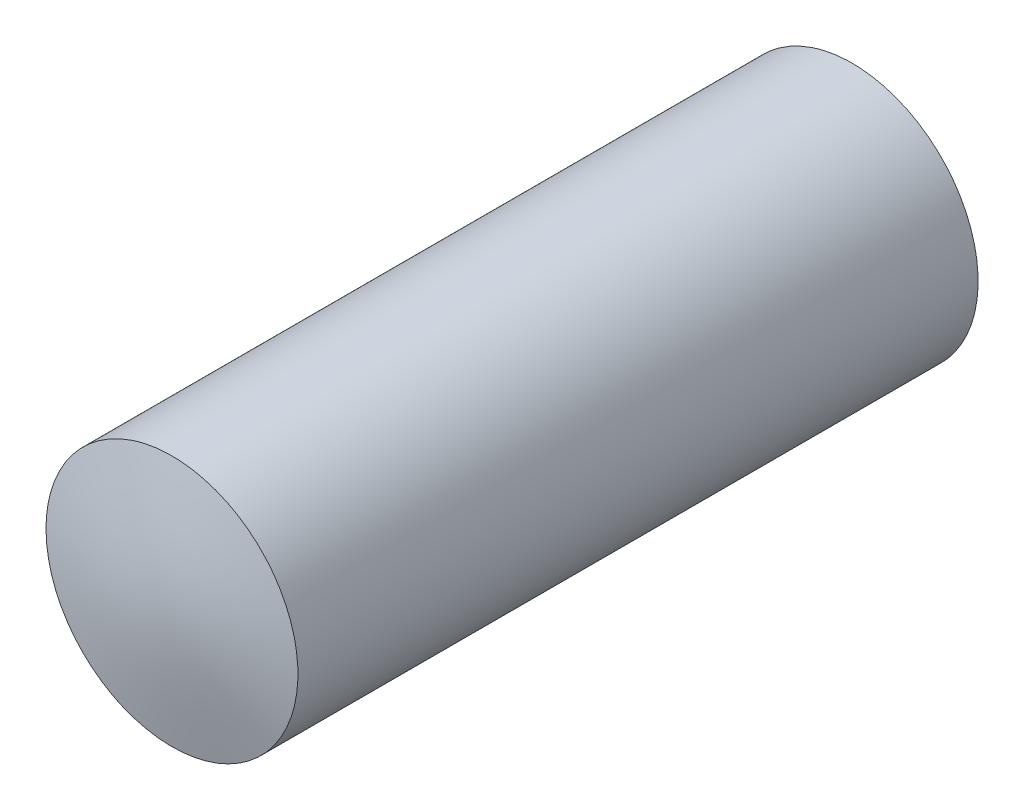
ISO-10303-21;
HEADER;
FILE_DESCRIPTION(('STEP AP214'),'2;1');
FILE_NAME('part.step','',(''),(''),'','','');
FILE_SCHEMA(('AUTOMOTIVE_DESIGN { 1 0 10303 214 1 1 1 1 }'));
ENDSEC;
DATA;
#1=APPLICATION_CONTEXT('core data for automotive mechanical design processes');
#2=APPLICATION_PROTOCOL_DEFINITION('international standard','automotive_design',2000,#1);
#3=PRODUCT_CONTEXT('',#1,'mechanical');
#4=PRODUCT('Part','Part','',(#3));
#5=PRODUCT_RELATED_PRODUCT_CATEGORY('part','',(#4));
#6=PRODUCT_DEFINITION_FORMATION('','',#4);
#7=PRODUCT_DEFINITION_CONTEXT('part definition',#1,'design');
#8=PRODUCT_DEFINITION('design','',#6,#7);
#9=PRODUCT_DEFINITION_SHAPE('','',#8);
#10=(LENGTH_UNIT() NAMED_UNIT(*) SI_UNIT(.MILLI.,.METRE.));
#11=(NAMED_UNIT(*) PLANE_ANGLE_UNIT() SI_UNIT($,.RADIAN.));
#12=(NAMED_UNIT(*) SI_UNIT($,.STERADIAN.) SOLID_ANGLE_UNIT());
#13=UNCERTAINTY_MEASURE_WITH_UNIT(LENGTH_MEASURE(1.E-05),#10,'distance_accuracy_value','');
#14=(GEOMETRIC_REPRESENTATION_CONTEXT(3) GLOBAL_UNCERTAINTY_ASSIGNED_CONTEXT((#13)) GLOBAL_UNIT_ASSIGNED_CONTEXT((#10,
#11,#12)) REPRESENTATION_CONTEXT('',''));
#15=CARTESIAN_POINT('',(0.,0.,0.));
#16=DIRECTION('',(0.,0.,1.));
#17=DIRECTION('',(1.,0.,0.));
#18=AXIS2_PLACEMENT_3D('',#15,#16,#17);
#19=CARTESIAN_POINT('',(0.,0.,16.2));
#20=DIRECTION('',(0.,0.,-1.));
#21=DIRECTION('',(-1.,0.,0.));
#22=AXIS2_PLACEMENT_3D('',#19,#20,#21);
#23=CYLINDRICAL_SURFACE('',#22,3.);
#24=CARTESIAN_POINT('',(-3.,1.29930179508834E-12,16.200141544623));
#25=CARTESIAN_POINT('',(-2.99999252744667,-0.168511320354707,16.2001422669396));
#26=CARTESIAN_POINT('',(-2.98575432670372,-0.337144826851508,16.2001584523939));
#27=CARTESIAN_POINT('',(-2.92915290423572,-0.669767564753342,16.2001462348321));
#28=CARTESIAN_POINT('',(-2.88675583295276,-0.833750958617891,16.2001177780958));
#29=CARTESIAN_POINT('',(-2.77504361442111,-1.1522065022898,16.2001001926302));
#30=CARTESIAN_POINT('',(-2.70574132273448,-1.30668315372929,16.2001110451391));
#31=CARTESIAN_POINT('',(-2.54220356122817,-1.60176565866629,16.200143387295));
#32=CARTESIAN_POINT('',(-2.44797429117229,-1.742374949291,16.2001648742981));
#33=CARTESIAN_POINT('',(-2.23723837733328,-2.00579557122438,16.2001895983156));
#34=CARTESIAN_POINT('',(-2.12072940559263,-2.1286050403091,16.2001928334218));
#35=CARTESIAN_POINT('',(-1.86874257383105,-2.3529252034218,16.2001785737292));
#36=CARTESIAN_POINT('',(-1.73326396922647,-2.45443506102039,16.2001610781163));
#37=CARTESIAN_POINT('',(-1.44719005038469,-2.63326699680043,16.2001199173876));
#38=CARTESIAN_POINT('',(-1.29659501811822,-2.71058952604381,16.2000962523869));
#39=CARTESIAN_POINT('',(-0.984561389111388,-2.83885417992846,16.200101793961));
#40=CARTESIAN_POINT('',(-0.82312281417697,-2.88979635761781,16.2001310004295));
#41=CARTESIAN_POINT('',(-0.493984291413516,-2.96385454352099,16.2001588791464));
#42=CARTESIAN_POINT('',(-0.326284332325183,-2.98697050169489,16.2001575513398));
#43=CARTESIAN_POINT('',(0.0106158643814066,-3.00471986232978,16.2001630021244));
#44=CARTESIAN_POINT('',(0.179816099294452,-2.99935331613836,16.2001697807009));
#45=CARTESIAN_POINT('',(0.514914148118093,-2.96029011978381,16.2001549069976));
#46=CARTESIAN_POINT('',(0.680811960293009,-2.92659345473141,16.2001332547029));
#47=CARTESIAN_POINT('',(1.00459590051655,-2.83182649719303,16.2001046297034));
#48=CARTESIAN_POINT('',(1.16248202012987,-2.77075617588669,16.2000976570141));
#49=CARTESIAN_POINT('',(1.46576039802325,-2.62297553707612,16.200117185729));
#50=CARTESIAN_POINT('',(1.61115266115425,-2.53626522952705,16.2001436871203));
#51=CARTESIAN_POINT('',(1.88531608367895,-2.33966609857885,16.2001800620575));
#52=CARTESIAN_POINT('',(2.01408724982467,-2.22977728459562,16.2001899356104));
#53=CARTESIAN_POINT('',(2.25135314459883,-1.98994050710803,16.2001890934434));
#54=CARTESIAN_POINT('',(2.35984786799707,-1.85999253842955,16.2001783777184));
#55=CARTESIAN_POINT('',(2.55348100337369,-1.58372629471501,16.2001429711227));
#56=CARTESIAN_POINT('',(2.6386194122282,-1.43740801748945,16.2001182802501));
#57=CARTESIAN_POINT('',(2.78312306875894,-1.13255471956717,16.2001042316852));
#58=CARTESIAN_POINT('',(2.84248831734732,-0.974019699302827,16.2001148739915));
#59=CARTESIAN_POINT('',(2.93376044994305,-0.649233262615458,16.2001363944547));
#60=CARTESIAN_POINT('',(2.96566733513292,-0.482981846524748,16.2001472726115));
#61=CARTESIAN_POINT('',(3.00111700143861,-0.147482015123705,16.2001519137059));
#62=CARTESIAN_POINT('',(3.00465978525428,0.0217663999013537,16.2001456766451));
#63=CARTESIAN_POINT('',(2.98328068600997,0.358455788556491,16.2001445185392));
#64=CARTESIAN_POINT('',(2.95835880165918,0.525896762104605,16.2001495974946));
#65=CARTESIAN_POINT('',(2.88075781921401,0.854218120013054,16.2001305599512));
#66=CARTESIAN_POINT('',(2.82807871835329,1.01509850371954,16.2001064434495));
#67=CARTESIAN_POINT('',(2.6964587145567,1.32573172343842,16.2001053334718));
#68=CARTESIAN_POINT('',(2.61751781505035,1.47548456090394,16.2001283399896));
#69=CARTESIAN_POINT('',(2.43561513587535,1.75961163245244,16.2001666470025));
#70=CARTESIAN_POINT('',(2.33265336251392,1.8939858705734,16.2001819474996));
#71=CARTESIAN_POINT('',(2.10563165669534,2.14354135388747,16.2001926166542));
#72=CARTESIAN_POINT('',(1.98157171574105,2.25872259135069,16.2001879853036));
#73=CARTESIAN_POINT('',(1.71587535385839,2.46662238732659,16.2001592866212));
#74=CARTESIAN_POINT('',(1.57423892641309,2.55934093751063,16.2001352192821));
#75=CARTESIAN_POINT('',(1.27741042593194,2.71968321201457,16.2001025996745));
#76=CARTESIAN_POINT('',(1.12221836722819,2.78730696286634,16.2000940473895));
#77=CARTESIAN_POINT('',(0.802683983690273,2.89554011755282,16.2001176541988));
#78=CARTESIAN_POINT('',(0.638341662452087,2.93614953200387,16.200149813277));
#79=CARTESIAN_POINT('',(0.305171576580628,2.98920132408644,16.2001707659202));
#80=CARTESIAN_POINT('',(0.136343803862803,3.00164365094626,16.200159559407));
#81=CARTESIAN_POINT('',(-0.201004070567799,2.99800792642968,16.2001586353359));
#82=CARTESIAN_POINT('',(-0.369524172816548,2.98192992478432,16.2001689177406));
#83=CARTESIAN_POINT('',(-0.701473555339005,2.92170995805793,16.2001451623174));
#84=CARTESIAN_POINT('',(-0.864902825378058,2.87756793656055,16.2001111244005));
#85=CARTESIAN_POINT('',(-1.18203386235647,2.7624719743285,16.2000922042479));
#86=CARTESIAN_POINT('',(-1.33573544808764,2.69151753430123,16.2001073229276));
#87=CARTESIAN_POINT('',(-1.62903875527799,2.52481392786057,16.2001445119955));
#88=CARTESIAN_POINT('',(-1.76864103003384,2.42906573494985,16.2001665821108));
#89=CARTESIAN_POINT('',(-2.02977595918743,2.21550403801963,16.2001906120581));
#90=CARTESIAN_POINT('',(-2.15131050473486,2.09769284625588,16.2001925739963));
#91=CARTESIAN_POINT('',(-2.37290656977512,1.84330447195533,16.2001769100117));
#92=CARTESIAN_POINT('',(-2.47296274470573,1.7067226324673,16.2001592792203));
#93=CARTESIAN_POINT('',(-2.64876247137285,1.41864627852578,16.2001216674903));
#94=CARTESIAN_POINT('',(-2.72449439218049,1.26714467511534,16.2001016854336));
#95=CARTESIAN_POINT('',(-2.84936113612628,0.953696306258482,16.2001089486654));
#96=CARTESIAN_POINT('',(-2.89852784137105,0.791762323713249,16.2001361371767));
#97=CARTESIAN_POINT('',(-2.95576453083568,0.523996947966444,16.200152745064));
#98=CARTESIAN_POINT('',(-2.97233212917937,0.419905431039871,16.2001525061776));
#99=CARTESIAN_POINT('',(-2.99445219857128,0.210558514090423,16.2001466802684));
#100=CARTESIAN_POINT('',(-3.00000466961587,0.105303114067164,16.2001410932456));
#101=CARTESIAN_POINT('',(-3.,1.29930179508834E-12,16.200141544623));
#102=B_SPLINE_CURVE_WITH_KNOTS('',3,(#24,#25,#26,#27,#28,#29,#30,#31,#32,#33,#34,#35,#36,#37,
#38,#39,#40,#41,#42,#43,#44,#45,#46,#47,#48,#49,#50,#51,#52,#53,#54,#55,#56,#57,#58,#59,#60,#61,
#62,#63,#64,#65,#66,#67,#68,#69,#70,#71,#72,#73,#74,#75,#76,#77,#78,#79,#80,#81,#82,#83,#84,#85,
#86,#87,#88,#89,#90,#91,#92,#93,#94,#95,#96,#97,#98,#99,#100,#101),.UNSPECIFIED.,.T.,.F.,(4,2,2,
2,2,2,2,2,2,2,2,2,2,2,2,2,2,2,2,2,2,2,2,2,2,2,2,2,2,2,2,2,2,2,2,2,2,2,4),(0.,0.505149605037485,
1.01090754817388,1.51642413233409,2.02181510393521,2.52725891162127,3.03272256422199,
3.53817679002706,4.04362999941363,4.54908411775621,5.05453732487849,5.55999079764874,
6.06544480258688,6.57089861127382,7.07635221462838,7.58180594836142,8.08725974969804,
8.59271353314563,9.09816729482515,9.6036210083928,10.1090747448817,10.6145285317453,
11.119982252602,11.625435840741,12.1308896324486,12.6363436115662,13.1417970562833,
13.6472503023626,14.15270445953,14.6581577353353,15.1636120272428,15.6690757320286,
16.1745195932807,16.6799105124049,17.185427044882,17.6911849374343,18.1963344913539,
18.512003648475,18.8276728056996),.UNSPECIFIED.);
#103=CARTESIAN_POINT('',(-3.,1.29930179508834E-12,16.200141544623));
#104=VERTEX_POINT('',#103);
#105=EDGE_CURVE('E12',#104,#104,#102,.T.);
#106=ORIENTED_EDGE('',*,*,#105,.F.);
#107=EDGE_LOOP('',(#106));
#108=FACE_BOUND('',#107,.T.);
#109=CARTESIAN_POINT('',(-3.,-1.40860975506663E-12,-0.000141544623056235));
#110=CARTESIAN_POINT('',(-2.99999252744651,-0.168511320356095,-0.000142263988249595));
#111=CARTESIAN_POINT('',(-2.98575432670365,-0.337144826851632,-0.000158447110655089));
#112=CARTESIAN_POINT('',(-2.92915290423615,-0.669767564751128,-0.000146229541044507));
#113=CARTESIAN_POINT('',(-2.88675583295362,-0.833750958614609,-0.000117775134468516));
#114=CARTESIAN_POINT('',(-2.77504361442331,-1.15220650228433,-0.000100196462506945));
#115=CARTESIAN_POINT('',(-2.70574132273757,-1.30668315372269,-0.000111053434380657));
#116=CARTESIAN_POINT('',(-2.54220356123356,-1.60176565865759,-0.000143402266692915));
#117=CARTESIAN_POINT('',(-2.44797429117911,-1.74237494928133,-0.000164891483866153));
#118=CARTESIAN_POINT('',(-2.23723837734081,-2.0057955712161,-0.000189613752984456));
#119=CARTESIAN_POINT('',(-2.12072940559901,-2.12860504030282,-0.000192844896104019));
#120=CARTESIAN_POINT('',(-1.86874257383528,-2.35292520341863,-0.000178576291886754));
#121=CARTESIAN_POINT('',(-1.73326396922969,-2.4544350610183,-0.000161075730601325));
#122=CARTESIAN_POINT('',(-1.44719005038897,-2.63326699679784,-0.000119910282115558));
#123=CARTESIAN_POINT('',(-1.296595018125,-2.71058952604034,-9.62455098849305E-05));
#124=CARTESIAN_POINT('',(-0.984561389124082,-2.83885417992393,-0.000101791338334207));
#125=CARTESIAN_POINT('',(-0.823122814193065,-2.88979635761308,-0.000131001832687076));
#126=CARTESIAN_POINT('',(-0.49398429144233,-2.96385454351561,-0.000158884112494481));
#127=CARTESIAN_POINT('',(-0.326284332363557,-2.98697050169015,-0.000157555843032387));
#128=CARTESIAN_POINT('',(0.0106158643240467,-3.00471986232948,-0.000163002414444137));
#129=CARTESIAN_POINT('',(0.179816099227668,-2.99935331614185,-0.0001697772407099));
#130=CARTESIAN_POINT('',(0.514914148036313,-2.96029011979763,-0.00015490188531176));
#131=CARTESIAN_POINT('',(0.680811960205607,-2.92659345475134,-0.000133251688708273));
#132=CARTESIAN_POINT('',(1.00459590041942,-2.8318264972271,-0.000104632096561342));
#133=CARTESIAN_POINT('',(1.16248202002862,-2.77075617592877,-9.76627164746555E-05));
#134=CARTESIAN_POINT('',(1.46576039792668,-2.62297553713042,-0.000117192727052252));
#135=CARTESIAN_POINT('',(1.61115266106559,-2.53626522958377,-0.000143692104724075));
#136=CARTESIAN_POINT('',(1.88531608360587,-2.33966609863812,-0.000180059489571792));
#137=CARTESIAN_POINT('',(2.01408724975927,-2.22977728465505,-0.00018992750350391));
#138=CARTESIAN_POINT('',(2.25135314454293,-1.98994050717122,-0.000189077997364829));
#139=CARTESIAN_POINT('',(2.35984786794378,-1.85999253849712,-0.000178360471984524));
#140=CARTESIAN_POINT('',(2.5534810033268,-1.58372629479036,-0.000142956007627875));
#141=CARTESIAN_POINT('',(2.63861941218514,-1.43740801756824,-0.000118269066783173));
#142=CARTESIAN_POINT('',(2.78312306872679,-1.13255471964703,-0.000104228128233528));
#143=CARTESIAN_POINT('',(2.84248831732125,-0.974019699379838,-0.000114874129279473));
#144=CARTESIAN_POINT('',(2.93376044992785,-0.64923326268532,-0.000136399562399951));
#145=CARTESIAN_POINT('',(2.96566733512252,-0.48298184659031,-0.000147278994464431));
#146=CARTESIAN_POINT('',(3.00111700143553,-0.147482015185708,-0.000151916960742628));
#147=CARTESIAN_POINT('',(3.00465978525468,0.0217663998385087,-0.000145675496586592));
#148=CARTESIAN_POINT('',(2.98328068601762,0.358455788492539,-0.000144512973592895));
#149=CARTESIAN_POINT('',(2.95835880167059,0.525896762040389,-0.000149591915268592));
#150=CARTESIAN_POINT('',(2.88075781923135,0.854218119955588,-0.000130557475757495));
#151=CARTESIAN_POINT('',(2.82807871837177,1.01509850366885,-0.000106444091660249));
#152=CARTESIAN_POINT('',(2.69645871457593,1.32573172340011,-0.000105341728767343));
#153=CARTESIAN_POINT('',(2.61751781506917,1.47548456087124,-0.00012835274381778));
#154=CARTESIAN_POINT('',(2.43561513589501,1.75961163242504,-0.000166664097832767));
#155=CARTESIAN_POINT('',(2.3326533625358,1.89398587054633,-0.000181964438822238));
#156=CARTESIAN_POINT('',(2.10563165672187,2.14354135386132,-0.00019262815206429));
#157=CARTESIAN_POINT('',(1.98157171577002,2.25872259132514,-0.000187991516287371));
#158=CARTESIAN_POINT('',(1.71587535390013,2.46662238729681,-0.000159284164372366));
#159=CARTESIAN_POINT('',(1.57423892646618,2.55934093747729,-0.000135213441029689));
#160=CARTESIAN_POINT('',(1.27741042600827,2.719683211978,-0.000102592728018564));
#161=CARTESIAN_POINT('',(1.12221836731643,2.78730696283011,-9.40427219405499E-05));
#162=CARTESIAN_POINT('',(0.802683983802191,2.89554011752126,-0.000117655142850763));
#163=CARTESIAN_POINT('',(0.638341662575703,2.93614953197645,-0.000149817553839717));
#164=CARTESIAN_POINT('',(0.305171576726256,2.98920132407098,-0.00017077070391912));
#165=CARTESIAN_POINT('',(0.136343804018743,3.0016436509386,-0.00015956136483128));
#166=CARTESIAN_POINT('',(-0.201004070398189,2.99800792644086,-0.000158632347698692));
#167=CARTESIAN_POINT('',(-0.36952417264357,2.98192992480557,-0.000168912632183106));
#168=CARTESIAN_POINT('',(-0.701473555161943,2.92170995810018,-0.000145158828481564));
#169=CARTESIAN_POINT('',(-0.864902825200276,2.87756793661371,-0.000111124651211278));
#170=CARTESIAN_POINT('',(-1.18203386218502,2.76247197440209,-9.2209868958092E-05));
#171=CARTESIAN_POINT('',(-1.33573544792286,2.69151753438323,-0.000107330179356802));
#172=CARTESIAN_POINT('',(-1.62903875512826,2.52481392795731,-0.00014451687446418));
#173=CARTESIAN_POINT('',(-1.76864102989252,2.42906573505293,-0.00016658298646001));
#174=CARTESIAN_POINT('',(-2.02977595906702,2.21550403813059,-0.000190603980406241));
#175=CARTESIAN_POINT('',(-2.15131050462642,2.09769284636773,-0.000192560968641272));
#176=CARTESIAN_POINT('',(-2.37290656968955,1.84330447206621,-0.000176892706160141));
#177=CARTESIAN_POINT('',(-2.47296274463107,1.70672263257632,-0.00015926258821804));
#178=CARTESIAN_POINT('',(-2.64876247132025,1.41864627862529,-0.000121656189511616));
#179=CARTESIAN_POINT('',(-2.72449439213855,1.26714467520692,-0.000101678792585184));
#180=CARTESIAN_POINT('',(-2.84936113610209,0.953696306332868,-0.000108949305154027));
#181=CARTESIAN_POINT('',(-2.89852784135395,0.791762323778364,-0.0001361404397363));
#182=CARTESIAN_POINT('',(-2.95576453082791,0.523996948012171,-0.000152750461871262));
#183=CARTESIAN_POINT('',(-2.97233212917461,0.419905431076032,-0.000152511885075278));
#184=CARTESIAN_POINT('',(-2.99445219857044,0.21055851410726,-0.000146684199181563));
#185=CARTESIAN_POINT('',(-3.00000466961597,0.105303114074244,-0.000141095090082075));
#186=CARTESIAN_POINT('',(-3.,-1.40860975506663E-12,-0.000141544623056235));
#187=B_SPLINE_CURVE_WITH_KNOTS('',3,(#109,#110,#111,#112,#113,#114,#115,#116,#117,#118,#119,
#120,#121,#122,#123,#124,#125,#126,#127,#128,#129,#130,#131,#132,#133,#134,#135,#136,#137,#138,
#139,#140,#141,#142,#143,#144,#145,#146,#147,#148,#149,#150,#151,#152,#153,#154,#155,#156,#157,
#158,#159,#160,#161,#162,#163,#164,#165,#166,#167,#168,#169,#170,#171,#172,#173,#174,#175,#176,
#177,#178,#179,#180,#181,#182,#183,#184,#185,#186),.UNSPECIFIED.,.T.,.F.,(4,2,2,2,2,2,2,2,2,2,2,
2,2,2,2,2,2,2,2,2,2,2,2,2,2,2,2,2,2,2,2,2,2,2,2,2,2,2,4),(0.,0.505149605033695,1.01090754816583,
1.51642413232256,2.02181510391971,2.52725891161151,3.03272256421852,3.538176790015,
4.04362999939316,4.54908411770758,5.05453732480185,5.55999079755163,6.06544480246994,
6.57089861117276,7.07635221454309,7.58180594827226,8.08725974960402,8.59271353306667,
9.09816729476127,9.60362100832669,10.1090747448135,10.6145285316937,11.1199822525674,
11.6254358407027,12.1308896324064,12.6363436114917,13.1417970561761,13.647250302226,
14.1527044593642,14.6581577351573,15.1636120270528,15.6690757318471,16.1745195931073,
16.6799105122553,17.1854270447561,17.6911849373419,18.1963344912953,18.5120036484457,
18.8276728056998),.UNSPECIFIED.);
#188=CARTESIAN_POINT('',(-3.,-1.40860975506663E-12,-0.000141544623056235));
#189=VERTEX_POINT('',#188);
#190=EDGE_CURVE('E102',#189,#189,#187,.T.);
#191=ORIENTED_EDGE('',*,*,#190,.T.);
#192=EDGE_LOOP('',(#191));
#193=FACE_BOUND('',#192,.T.);
#194=ADVANCED_FACE('F89',(#108,#193),#23,.T.);
#195=CARTESIAN_POINT('',(3.12665197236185,-3.11496777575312,15.8980067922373));
#196=CARTESIAN_POINT('',(2.62638888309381,-3.11496777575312,15.9676443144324));
#197=CARTESIAN_POINT('',(2.12612579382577,-3.11496777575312,16.030902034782));
#198=CARTESIAN_POINT('',(1.62586270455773,-3.11496777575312,16.0897707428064));
#199=CARTESIAN_POINT('',(0.875467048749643,-3.11496777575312,16.1569155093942));
#200=CARTESIAN_POINT('',(0.125071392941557,-3.11496777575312,16.175395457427));
#201=CARTESIAN_POINT('',(-0.125061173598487,-3.11496777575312,16.1753955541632));
#202=CARTESIAN_POINT('',(-0.87545887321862,-3.11496777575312,16.1569161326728));
#203=CARTESIAN_POINT('',(-1.62585657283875,-3.11496777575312,16.0897714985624));
#204=CARTESIAN_POINT('',(-2.12612170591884,-3.11496777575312,16.0309025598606));
#205=CARTESIAN_POINT('',(-2.62638683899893,-3.11496777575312,15.9676445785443));
#206=CARTESIAN_POINT('',(-3.12665197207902,-3.11496777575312,15.8980067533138));
#207=CARTESIAN_POINT('',(3.12665197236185,-2.61657415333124,15.9669478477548));
#208=CARTESIAN_POINT('',(2.62638888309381,-2.61657415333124,16.0479942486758));
#209=CARTESIAN_POINT('',(2.12612579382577,-2.61657415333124,16.1225628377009));
#210=CARTESIAN_POINT('',(1.62586270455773,-2.61657415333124,16.1932562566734));
#211=CARTESIAN_POINT('',(0.875467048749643,-2.61657415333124,16.2745928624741));
#212=CARTESIAN_POINT('',(0.125071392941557,-2.61657415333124,16.2970582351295));
#213=CARTESIAN_POINT('',(-0.125061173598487,-2.61657415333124,16.2970583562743));
#214=CARTESIAN_POINT('',(-0.87545887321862,-2.61657415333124,16.2745936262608));
#215=CARTESIAN_POINT('',(-1.62585657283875,-2.61657415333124,16.1932571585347));
#216=CARTESIAN_POINT('',(-2.12612170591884,-2.61657415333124,16.1225634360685));
#217=CARTESIAN_POINT('',(-2.62638683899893,-2.61657415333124,16.0479945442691));
#218=CARTESIAN_POINT('',(-3.12665197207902,-2.61657415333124,15.9669478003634));
#219=CARTESIAN_POINT('',(3.12665197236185,-2.11818053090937,16.0295560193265));
#220=CARTESIAN_POINT('',(2.62638888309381,-2.11818053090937,16.1219089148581));
#221=CARTESIAN_POINT('',(2.12612579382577,-2.11818053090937,16.2076020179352));
#222=CARTESIAN_POINT('',(1.62586270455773,-2.11818053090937,16.2904799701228));
#223=CARTESIAN_POINT('',(0.875467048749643,-2.11818053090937,16.3864832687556));
#224=CARTESIAN_POINT('',(0.125071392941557,-2.11818053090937,16.4130892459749));
#225=CARTESIAN_POINT('',(-0.125061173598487,-2.11818053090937,16.413089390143));
#226=CARTESIAN_POINT('',(-0.87545887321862,-2.11818053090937,16.3864841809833));
#227=CARTESIAN_POINT('',(-1.62585657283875,-2.11818053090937,16.2904810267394));
#228=CARTESIAN_POINT('',(-2.12612170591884,-2.11818053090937,16.2076026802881));
#229=CARTESIAN_POINT('',(-2.62638683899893,-2.11818053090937,16.1219092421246));
#230=CARTESIAN_POINT('',(-3.12665197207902,-2.11818053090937,16.0295559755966));
#231=CARTESIAN_POINT('',(3.12665197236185,-1.6197869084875,16.087840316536));
#232=CARTESIAN_POINT('',(2.62638888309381,-1.6197869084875,16.192008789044));
#233=CARTESIAN_POINT('',(2.12612579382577,-1.6197869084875,16.2898510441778));
#234=CARTESIAN_POINT('',(1.62586270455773,-1.6197869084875,16.3859525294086));
#235=CARTESIAN_POINT('',(0.875467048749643,-1.6197869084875,16.495644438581));
#236=CARTESIAN_POINT('',(0.125071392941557,-1.6197869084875,16.5264307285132));
#237=CARTESIAN_POINT('',(-0.125061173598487,-1.6197869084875,16.5264309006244));
#238=CARTESIAN_POINT('',(-0.87545887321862,-1.6197869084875,16.4956454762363));
#239=CARTESIAN_POINT('',(-1.62585657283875,-1.6197869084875,16.3859537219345));
#240=CARTESIAN_POINT('',(-2.12612170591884,-1.6197869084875,16.2898518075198));
#241=CARTESIAN_POINT('',(-2.62638683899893,-1.6197869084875,16.1920092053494));
#242=CARTESIAN_POINT('',(-3.12665197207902,-1.6197869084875,16.087840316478));
#243=CARTESIAN_POINT('',(3.12665197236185,-0.872195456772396,16.1542238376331));
#244=CARTESIAN_POINT('',(2.62638888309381,-0.872195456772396,16.2726150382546));
#245=CARTESIAN_POINT('',(2.12612579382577,-0.872195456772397,16.3851671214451));
#246=CARTESIAN_POINT('',(1.62586270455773,-0.872195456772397,16.4949574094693));
#247=CARTESIAN_POINT('',(0.875467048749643,-0.872195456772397,16.630575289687));
#248=CARTESIAN_POINT('',(0.125071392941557,-0.872195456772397,16.6692743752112));
#249=CARTESIAN_POINT('',(-0.125061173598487,-0.872195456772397,16.6692745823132));
#250=CARTESIAN_POINT('',(-0.87545887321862,-0.872195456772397,16.630576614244));
#251=CARTESIAN_POINT('',(-1.62585657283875,-0.872195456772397,16.4949587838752));
#252=CARTESIAN_POINT('',(-2.12612170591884,-0.872195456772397,16.385168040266));
#253=CARTESIAN_POINT('',(-2.62638683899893,-0.872195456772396,16.2726155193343));
#254=CARTESIAN_POINT('',(-3.12665197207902,-0.872195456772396,16.15422384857));
#255=CARTESIAN_POINT('',(3.12665197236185,-0.124604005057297,16.1724557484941));
#256=CARTESIAN_POINT('',(2.62638888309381,-0.124604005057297,16.294854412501));
#257=CARTESIAN_POINT('',(2.12612579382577,-0.124604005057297,16.4115782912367));
#258=CARTESIAN_POINT('',(1.62586270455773,-0.124604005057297,16.5255590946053));
#259=CARTESIAN_POINT('',(0.875467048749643,-0.124604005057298,16.6690893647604));
#260=CARTESIAN_POINT('',(0.125071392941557,-0.124604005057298,16.7136228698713));
#261=CARTESIAN_POINT('',(-0.125061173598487,-0.124604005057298,16.713623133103));
#262=CARTESIAN_POINT('',(-0.87545887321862,-0.124604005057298,16.6690907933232));
#263=CARTESIAN_POINT('',(-1.62585657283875,-0.124604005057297,16.5255605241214));
#264=CARTESIAN_POINT('',(-2.12612170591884,-0.124604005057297,16.4115792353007));
#265=CARTESIAN_POINT('',(-2.62638683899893,-0.124604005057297,16.2948549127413));
#266=CARTESIAN_POINT('',(-3.12665197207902,-0.124604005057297,16.1724557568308));
#267=CARTESIAN_POINT('',(3.12665197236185,0.124593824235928,16.1724558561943));
#268=CARTESIAN_POINT('',(2.62638888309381,0.124593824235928,16.2948545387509));
#269=CARTESIAN_POINT('',(2.12612579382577,0.124593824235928,16.4115784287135));
#270=CARTESIAN_POINT('',(1.62586270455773,0.124593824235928,16.5255592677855));
#271=CARTESIAN_POINT('',(0.875467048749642,0.124593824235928,16.6690895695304));
#272=CARTESIAN_POINT('',(0.125071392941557,0.124593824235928,16.7136231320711));
#273=CARTESIAN_POINT('',(-0.125061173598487,0.124593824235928,16.7136233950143));
#274=CARTESIAN_POINT('',(-0.875458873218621,0.124593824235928,16.6690910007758));
#275=CARTESIAN_POINT('',(-1.62585657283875,0.124593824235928,16.5255606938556));
#276=CARTESIAN_POINT('',(-2.12612170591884,0.124593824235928,16.4115793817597));
#277=CARTESIAN_POINT('',(-2.62638683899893,0.124593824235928,16.294855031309));
#278=CARTESIAN_POINT('',(-3.12665197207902,0.124593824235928,16.1724558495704));
#279=CARTESIAN_POINT('',(3.12665197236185,0.872187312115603,16.154224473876));
#280=CARTESIAN_POINT('',(2.62638888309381,0.872187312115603,16.272615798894));
#281=CARTESIAN_POINT('',(2.12612579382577,0.872187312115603,16.3851680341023));
#282=CARTESIAN_POINT('',(1.62586270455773,0.872187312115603,16.4949584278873));
#283=CARTESIAN_POINT('',(0.875467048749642,0.872187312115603,16.6305766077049));
#284=CARTESIAN_POINT('',(0.125071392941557,0.872187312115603,16.6692757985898));
#285=CARTESIAN_POINT('',(-0.125061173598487,0.872187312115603,16.6692760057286));
#286=CARTESIAN_POINT('',(-0.875458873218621,0.872187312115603,16.6305779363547));
#287=CARTESIAN_POINT('',(-1.62585657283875,0.872187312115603,16.4949598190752));
#288=CARTESIAN_POINT('',(-2.12612170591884,0.872187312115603,16.3851689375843));
#289=CARTESIAN_POINT('',(-2.62638683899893,0.872187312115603,16.2726162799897));
#290=CARTESIAN_POINT('',(-3.12665197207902,0.872187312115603,16.154224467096));
#291=CARTESIAN_POINT('',(3.12665197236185,1.61978079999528,16.0878410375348));
#292=CARTESIAN_POINT('',(2.62638888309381,1.61978079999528,16.1920096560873));
#293=CARTESIAN_POINT('',(2.12612579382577,1.61978079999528,16.2898520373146));
#294=CARTESIAN_POINT('',(1.62586270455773,1.61978079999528,16.3859537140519));
#295=CARTESIAN_POINT('',(0.875467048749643,1.61978079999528,16.4956458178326));
#296=CARTESIAN_POINT('',(0.125071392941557,1.61978079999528,16.5264321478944));
#297=CARTESIAN_POINT('',(-0.125061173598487,1.61978079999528,16.5264323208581));
#298=CARTESIAN_POINT('',(-0.87545887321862,1.61978079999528,16.4956468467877));
#299=CARTESIAN_POINT('',(-1.62585657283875,1.61978079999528,16.3859549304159));
#300=CARTESIAN_POINT('',(-2.12612170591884,1.61978079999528,16.2898528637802));
#301=CARTESIAN_POINT('',(-2.62638683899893,1.61978079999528,16.1920100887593));
#302=CARTESIAN_POINT('',(-3.12665197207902,1.61978079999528,16.0878410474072));
#303=CARTESIAN_POINT('',(3.12665197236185,2.11817645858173,16.02955646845));
#304=CARTESIAN_POINT('',(2.62638888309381,2.11817645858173,16.1219094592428));
#305=CARTESIAN_POINT('',(2.12612579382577,2.11817645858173,16.2076026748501));
#306=CARTESIAN_POINT('',(1.62586270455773,2.11817645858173,16.2904807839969));
#307=CARTESIAN_POINT('',(0.875467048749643,2.11817645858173,16.3864841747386));
#308=CARTESIAN_POINT('',(0.125071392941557,2.11817645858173,16.4130901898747));
#309=CARTESIAN_POINT('',(-0.125061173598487,2.11817645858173,16.4130903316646));
#310=CARTESIAN_POINT('',(-0.87545887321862,2.11817645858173,16.3864850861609));
#311=CARTESIAN_POINT('',(-1.62585657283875,2.11817645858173,16.2904817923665));
#312=CARTESIAN_POINT('',(-2.12612170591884,2.11817645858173,16.2076033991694));
#313=CARTESIAN_POINT('',(-2.62638683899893,2.11817645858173,16.1219098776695));
#314=CARTESIAN_POINT('',(-3.12665197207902,2.11817645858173,16.0295565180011));
#315=CARTESIAN_POINT('',(3.12665197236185,2.61657211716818,15.9669480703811));
#316=CARTESIAN_POINT('',(2.62638888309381,2.61657211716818,16.0479945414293));
#317=CARTESIAN_POINT('',(2.12612579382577,2.61657211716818,16.1225632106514));
#318=CARTESIAN_POINT('',(1.62586270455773,2.61657211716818,16.1932566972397));
#319=CARTESIAN_POINT('',(0.875467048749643,2.61657211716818,16.2745933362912));
#320=CARTESIAN_POINT('',(0.125071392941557,2.61657211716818,16.29705872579));
#321=CARTESIAN_POINT('',(-0.125061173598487,2.61657211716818,16.2970588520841));
#322=CARTESIAN_POINT('',(-0.87545887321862,2.61657211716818,16.2745941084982));
#323=CARTESIAN_POINT('',(-1.62585657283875,2.61657211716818,16.1932575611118));
#324=CARTESIAN_POINT('',(-2.12612170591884,2.61657211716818,16.1225638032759));
#325=CARTESIAN_POINT('',(-2.62638683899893,2.61657211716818,16.0479948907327));
#326=CARTESIAN_POINT('',(-3.12665197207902,2.61657211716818,15.9669481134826));
#327=CARTESIAN_POINT('',(3.12665197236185,3.11496777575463,15.8980067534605));
#328=CARTESIAN_POINT('',(2.62638888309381,3.11496777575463,15.9676443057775));
#329=CARTESIAN_POINT('',(2.12612579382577,3.11496777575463,16.0309020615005));
#330=CARTESIAN_POINT('',(1.62586270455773,3.11496777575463,16.0897707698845));
#331=CARTESIAN_POINT('',(0.875467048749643,3.11496777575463,16.1569154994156));
#332=CARTESIAN_POINT('',(0.125071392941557,3.11496777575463,16.1753954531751));
#333=CARTESIAN_POINT('',(-0.125061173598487,3.11496777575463,16.175395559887));
#334=CARTESIAN_POINT('',(-0.87545887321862,3.11496777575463,16.1569161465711));
#335=CARTESIAN_POINT('',(-1.62585657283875,3.11496777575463,16.0897714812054));
#336=CARTESIAN_POINT('',(-2.12612170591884,3.11496777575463,16.030902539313));
#337=CARTESIAN_POINT('',(-2.62638683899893,3.11496777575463,15.9676445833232));
#338=CARTESIAN_POINT('',(-3.12665197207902,3.11496777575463,15.8980067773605));
#339=B_SPLINE_SURFACE_WITH_KNOTS('',5,5,((#195,#196,#197,#198,#199,#200,#201,#202,#203,#204,
#205,#206),(#207,#208,#209,#210,#211,#212,#213,#214,#215,#216,#217,#218),(#219,#220,#221,#222,
#223,#224,#225,#226,#227,#228,#229,#230),(#231,#232,#233,#234,#235,#236,#237,#238,#239,#240,
#241,#242),(#243,#244,#245,#246,#247,#248,#249,#250,#251,#252,#253,#254),(#255,#256,#257,#258,
#259,#260,#261,#262,#263,#264,#265,#266),(#267,#268,#269,#270,#271,#272,#273,#274,#275,#276,
#277,#278),(#279,#280,#281,#282,#283,#284,#285,#286,#287,#288,#289,#290),(#291,#292,#293,#294,
#295,#296,#297,#298,#299,#300,#301,#302),(#303,#304,#305,#306,#307,#308,#309,#310,#311,#312,
#313,#314),(#315,#316,#317,#318,#319,#320,#321,#322,#323,#324,#325,#326),(#327,#328,#329,#330,
#331,#332,#333,#334,#335,#336,#337,#338)),.UNSPECIFIED.,.F.,.F.,.F.,(6,3,3,6),(6,3,3,6),
(-3.11496777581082,-0.622999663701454,0.622989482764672,3.11496777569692),(-3.12665197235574,
-0.625336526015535,0.625326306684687,3.12665197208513),.UNSPECIFIED.);
#340=ORIENTED_EDGE('',*,*,#105,.T.);
#341=EDGE_LOOP('',(#340));
#342=FACE_BOUND('',#341,.T.);
#343=ADVANCED_FACE('F91',(#342),#339,.T.);
#344=CARTESIAN_POINT('',(3.12665197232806,-3.11496777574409,0.301993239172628));
#345=CARTESIAN_POINT('',(2.62638888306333,-3.11496777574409,0.23235569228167));
#346=CARTESIAN_POINT('',(2.1261257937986,-3.11496777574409,0.169097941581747));
#347=CARTESIAN_POINT('',(1.62586270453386,-3.11496777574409,0.110229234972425));
#348=CARTESIAN_POINT('',(0.875467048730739,-3.11496777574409,0.0430845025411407));
#349=CARTESIAN_POINT('',(0.125071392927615,-3.11496777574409,0.0246045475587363));
#350=CARTESIAN_POINT('',(-0.125061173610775,-3.11496777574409,0.0246044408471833));
#351=CARTESIAN_POINT('',(-0.875458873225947,-3.11496777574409,0.043083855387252));
#352=CARTESIAN_POINT('',(-1.62585657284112,-3.11496777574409,0.110228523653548));
#353=CARTESIAN_POINT('',(-2.1261217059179,-3.11496777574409,0.169097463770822));
#354=CARTESIAN_POINT('',(-2.62638683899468,-3.1149677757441,0.232355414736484));
#355=CARTESIAN_POINT('',(-3.12665197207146,-3.11496777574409,0.301993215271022));
#356=CARTESIAN_POINT('',(3.12665197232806,-2.61657415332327,0.233052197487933));
#357=CARTESIAN_POINT('',(2.62638888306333,-2.61657415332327,0.152005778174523));
#358=CARTESIAN_POINT('',(2.1261257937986,-2.61657415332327,0.0774371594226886));
#359=CARTESIAN_POINT('',(1.62586270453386,-2.61657415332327,0.00674372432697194));
#360=CARTESIAN_POINT('',(0.875467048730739,-2.61657415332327,-0.0745928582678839));
#361=CARTESIAN_POINT('',(0.125071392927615,-2.61657415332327,-0.0970582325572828));
#362=CARTESIAN_POINT('',(-0.125061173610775,-2.61657415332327,-0.0970583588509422));
#363=CARTESIAN_POINT('',(-0.875458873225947,-2.61657415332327,-0.0745936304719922));
#364=CARTESIAN_POINT('',(-1.62585657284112,-2.61657415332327,0.00674286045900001));
#365=CARTESIAN_POINT('',(-2.1261217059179,-2.61657415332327,0.0774365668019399));
#366=CARTESIAN_POINT('',(-2.62638683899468,-2.61657415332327,0.152005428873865));
#367=CARTESIAN_POINT('',(-3.12665197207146,-2.61657415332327,0.233052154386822));
#368=CARTESIAN_POINT('',(3.12665197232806,-2.11818053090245,0.170444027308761));
#369=CARTESIAN_POINT('',(2.62638888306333,-2.11818053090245,0.0780911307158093));
#370=CARTESIAN_POINT('',(2.1261257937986,-2.11818053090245,-0.0076019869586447));
#371=CARTESIAN_POINT('',(1.62586270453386,-2.11818053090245,-0.0904799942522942));
#372=CARTESIAN_POINT('',(0.875467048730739,-2.11818053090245,-0.186483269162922));
#373=CARTESIAN_POINT('',(0.125071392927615,-2.11818053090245,-0.213089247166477));
#374=CARTESIAN_POINT('',(-0.125061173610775,-2.11818053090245,-0.213089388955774));
#375=CARTESIAN_POINT('',(-0.875458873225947,-2.11818053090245,-0.186484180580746));
#376=CARTESIAN_POINT('',(-1.62585657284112,-2.11818053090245,-0.0904810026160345));
#377=CARTESIAN_POINT('',(-2.1261217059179,-2.11818053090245,-0.00760271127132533));
#378=CARTESIAN_POINT('',(-2.62638683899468,-2.11818053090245,0.0780907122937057));
#379=CARTESIAN_POINT('',(-3.12665197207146,-2.11818053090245,0.170443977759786));
#380=CARTESIAN_POINT('',(3.12665197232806,-1.61978690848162,0.112159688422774));
#381=CARTESIAN_POINT('',(2.62638888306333,-1.61978690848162,0.00799121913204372));
#382=CARTESIAN_POINT('',(2.1261257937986,-1.61978690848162,-0.0898510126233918));
#383=CARTESIAN_POINT('',(1.62586270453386,-1.61978690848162,-0.185952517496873));
#384=CARTESIAN_POINT('',(0.875467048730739,-1.61978690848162,-0.295644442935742));
#385=CARTESIAN_POINT('',(0.125071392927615,-1.61978690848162,-0.326430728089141));
#386=CARTESIAN_POINT('',(-0.125061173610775,-1.61978690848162,-0.326430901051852));
#387=CARTESIAN_POINT('',(-0.875458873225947,-1.61978690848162,-0.295645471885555));
#388=CARTESIAN_POINT('',(-1.62585657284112,-1.61978690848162,-0.185953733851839));
#389=CARTESIAN_POINT('',(-2.1261217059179,-1.61978690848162,-0.0898518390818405));
#390=CARTESIAN_POINT('',(-2.62638683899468,-1.61978690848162,0.0079907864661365));
#391=CARTESIAN_POINT('',(-3.12665197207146,-1.61978690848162,0.112159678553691));
#392=CARTESIAN_POINT('',(3.12665197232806,-0.872195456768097,0.0457761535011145));
#393=CARTESIAN_POINT('',(2.62638888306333,-0.872195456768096,-0.072615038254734));
#394=CARTESIAN_POINT('',(2.1261257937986,-0.872195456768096,-0.18516712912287));
#395=CARTESIAN_POINT('',(1.62586270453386,-0.872195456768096,-0.294957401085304));
#396=CARTESIAN_POINT('',(0.875467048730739,-0.872195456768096,-0.430575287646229));
#397=CARTESIAN_POINT('',(0.125071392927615,-0.872195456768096,-0.46927437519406));
#398=CARTESIAN_POINT('',(-0.125061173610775,-0.872195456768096,-0.469274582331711));
#399=CARTESIAN_POINT('',(-0.875458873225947,-0.872195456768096,-0.430576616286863));
#400=CARTESIAN_POINT('',(-1.62585657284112,-0.872195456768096,-0.294958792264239));
#401=CARTESIAN_POINT('',(-2.1261217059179,-0.872195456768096,-0.185168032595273));
#402=CARTESIAN_POINT('',(-2.62638683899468,-0.872195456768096,-0.0726155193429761));
#403=CARTESIAN_POINT('',(-3.12665197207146,-0.872195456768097,0.0457761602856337));
#404=CARTESIAN_POINT('',(3.12665197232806,-0.124604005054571,0.0275442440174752));
#405=CARTESIAN_POINT('',(2.62638888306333,-0.124604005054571,-0.0948544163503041));
#406=CARTESIAN_POINT('',(2.1261257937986,-0.124604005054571,-0.211578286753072));
#407=CARTESIAN_POINT('',(1.62586270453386,-0.124604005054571,-0.325559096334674));
#408=CARTESIAN_POINT('',(0.875467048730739,-0.12460400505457,-0.469089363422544));
#409=CARTESIAN_POINT('',(0.125071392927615,-0.12460400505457,-0.513622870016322));
#410=CARTESIAN_POINT('',(-0.125061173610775,-0.12460400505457,-0.513623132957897));
#411=CARTESIAN_POINT('',(-0.875458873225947,-0.12460400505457,-0.46909079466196));
#412=CARTESIAN_POINT('',(-1.62585657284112,-0.124604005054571,-0.32556052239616));
#413=CARTESIAN_POINT('',(-2.1261217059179,-0.124604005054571,-0.211579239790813));
#414=CARTESIAN_POINT('',(-2.62638683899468,-0.124604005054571,-0.0948549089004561));
#415=CARTESIAN_POINT('',(-3.12665197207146,-0.124604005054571,0.0275442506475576));
#416=CARTESIAN_POINT('',(3.12665197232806,0.12459382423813,0.0275441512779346));
#417=CARTESIAN_POINT('',(2.62638888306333,0.12459382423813,-0.0948545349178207));
#418=CARTESIAN_POINT('',(2.1261257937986,0.12459382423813,-0.211578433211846));
#419=CARTESIAN_POINT('',(1.62586270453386,0.12459382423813,-0.325559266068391));
#420=CARTESIAN_POINT('',(0.875467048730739,0.124593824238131,-0.469089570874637));
#421=CARTESIAN_POINT('',(0.125071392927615,0.124593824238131,-0.513623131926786));
#422=CARTESIAN_POINT('',(-0.125061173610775,0.124593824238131,-0.513623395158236));
#423=CARTESIAN_POINT('',(-0.875458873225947,0.124593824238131,-0.469090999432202));
#424=CARTESIAN_POINT('',(-1.62585657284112,0.12459382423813,-0.325560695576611));
#425=CARTESIAN_POINT('',(-2.1261217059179,0.12459382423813,-0.211579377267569));
#426=CARTESIAN_POINT('',(-2.62638683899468,0.12459382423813,-0.0948550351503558));
#427=CARTESIAN_POINT('',(-3.12665197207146,0.12459382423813,0.0275441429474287));
#428=CARTESIAN_POINT('',(3.12665197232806,0.872187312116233,0.0457755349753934));
#429=CARTESIAN_POINT('',(2.62638888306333,0.872187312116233,-0.0726157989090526));
#430=CARTESIAN_POINT('',(2.1261257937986,0.872187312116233,-0.185168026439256));
#431=CARTESIAN_POINT('',(1.62586270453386,0.872187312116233,-0.294958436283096));
#432=CARTESIAN_POINT('',(0.875467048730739,0.872187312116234,-0.430576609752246));
#433=CARTESIAN_POINT('',(0.125071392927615,0.872187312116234,-0.469275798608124));
#434=CARTESIAN_POINT('',(-0.125061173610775,0.872187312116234,-0.469276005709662));
#435=CARTESIAN_POINT('',(-0.875458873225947,0.872187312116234,-0.430577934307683));
#436=CARTESIAN_POINT('',(-1.62585657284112,0.872187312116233,-0.294959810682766));
#437=CARTESIAN_POINT('',(-2.1261217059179,0.872187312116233,-0.185168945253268));
#438=CARTESIAN_POINT('',(-2.62638683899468,0.872187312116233,-0.0726162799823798));
#439=CARTESIAN_POINT('',(-3.12665197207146,0.872187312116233,0.0457755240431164));
#440=CARTESIAN_POINT('',(3.12665197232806,1.61978079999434,0.112158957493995));
#441=CARTESIAN_POINT('',(2.62638888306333,1.61978079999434,0.00799033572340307));
#442=CARTESIAN_POINT('',(2.1261257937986,1.61978079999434,-0.0898520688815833));
#443=CARTESIAN_POINT('',(1.62586270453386,1.61978079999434,-0.185953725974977));
#444=CARTESIAN_POINT('',(0.875467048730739,1.61978079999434,-0.295645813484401));
#445=CARTESIAN_POINT('',(0.125071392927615,1.61978079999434,-0.326432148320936));
#446=CARTESIAN_POINT('',(-0.125061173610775,1.61978079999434,-0.32643232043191));
#447=CARTESIAN_POINT('',(-0.875458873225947,1.61978079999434,-0.295646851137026));
#448=CARTESIAN_POINT('',(-1.62585657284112,1.61978079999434,-0.18595491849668));
#449=CARTESIAN_POINT('',(-2.1261217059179,1.61978079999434,-0.0898528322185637));
#450=CARTESIAN_POINT('',(-2.62638683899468,1.61978079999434,0.00798991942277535));
#451=CARTESIAN_POINT('',(-3.12665197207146,1.61978079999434,0.112158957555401));
#452=CARTESIAN_POINT('',(3.12665197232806,2.11817645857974,0.170443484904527));
#453=CARTESIAN_POINT('',(2.62638888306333,2.11817645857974,0.078090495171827));
#454=CARTESIAN_POINT('',(2.1261257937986,2.11817645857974,-0.00760270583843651));
#455=CARTESIAN_POINT('',(1.62586270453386,2.11817645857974,-0.0904807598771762));
#456=CARTESIAN_POINT('',(0.875467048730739,2.11817645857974,-0.186484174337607));
#457=CARTESIAN_POINT('',(0.125071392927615,2.11817645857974,-0.213090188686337));
#458=CARTESIAN_POINT('',(-0.125061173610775,2.11817645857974,-0.213090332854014));
#459=CARTESIAN_POINT('',(-0.875458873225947,2.11817645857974,-0.186485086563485));
#460=CARTESIAN_POINT('',(-1.62585657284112,2.11817645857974,-0.0904818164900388));
#461=CARTESIAN_POINT('',(-2.1261217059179,2.11817645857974,-0.00760336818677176));
#462=CARTESIAN_POINT('',(-2.62638683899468,2.11817645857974,0.0780901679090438));
#463=CARTESIAN_POINT('',(-3.12665197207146,2.11817645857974,0.170443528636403));
#464=CARTESIAN_POINT('',(3.12665197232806,2.61657211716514,0.23305188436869));
#465=CARTESIAN_POINT('',(2.62638888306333,2.61657211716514,0.15200543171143));
#466=CARTESIAN_POINT('',(2.1261257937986,2.61657211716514,0.0774367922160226));
#467=CARTESIAN_POINT('',(1.62586270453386,2.61657211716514,0.00674332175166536));
#468=CARTESIAN_POINT('',(0.875467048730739,2.61657211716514,-0.0745933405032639));
#469=CARTESIAN_POINT('',(0.125071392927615,2.61657211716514,-0.0970587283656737));
#470=CARTESIAN_POINT('',(-0.125061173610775,2.61657211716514,-0.0970588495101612));
#471=CARTESIAN_POINT('',(-0.875458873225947,2.61657211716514,-0.0745941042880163));
#472=CARTESIAN_POINT('',(-1.62585657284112,2.61657211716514,0.00674241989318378));
#473=CARTESIAN_POINT('',(-2.1261217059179,2.61657211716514,0.0774361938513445));
#474=CARTESIAN_POINT('',(-2.62638683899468,2.61657211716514,0.152005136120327));
#475=CARTESIAN_POINT('',(-3.12665197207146,2.61657211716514,0.23305193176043));
#476=CARTESIAN_POINT('',(3.12665197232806,3.11496777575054,0.30199321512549));
#477=CARTESIAN_POINT('',(2.62638888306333,3.11496777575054,0.232355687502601));
#478=CARTESIAN_POINT('',(2.1261257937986,3.11496777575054,0.169097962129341));
#479=CARTESIAN_POINT('',(1.62586270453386,3.11496777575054,0.110229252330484));
#480=CARTESIAN_POINT('',(0.875467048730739,3.11496777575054,0.0430844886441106));
#481=CARTESIAN_POINT('',(0.125071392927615,3.11496777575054,0.0246045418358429));
#482=CARTESIAN_POINT('',(-0.125061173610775,3.11496777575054,0.0246044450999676));
#483=CARTESIAN_POINT('',(-0.875458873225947,3.11496777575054,0.0430838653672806));
#484=CARTESIAN_POINT('',(-1.62585657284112,3.11496777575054,0.110228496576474));
#485=CARTESIAN_POINT('',(-2.1261217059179,3.11496777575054,0.16909743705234));
#486=CARTESIAN_POINT('',(-2.62638683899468,3.11496777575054,0.232355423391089));
#487=CARTESIAN_POINT('',(-3.12665197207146,3.11496777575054,0.301993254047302));
#488=B_SPLINE_SURFACE_WITH_KNOTS('',5,5,((#344,#345,#346,#347,#348,#349,#350,#351,#352,#353,
#354,#355),(#356,#357,#358,#359,#360,#361,#362,#363,#364,#365,#366,#367),(#368,#369,#370,#371,
#372,#373,#374,#375,#376,#377,#378,#379),(#380,#381,#382,#383,#384,#385,#386,#387,#388,#389,
#390,#391),(#392,#393,#394,#395,#396,#397,#398,#399,#400,#401,#402,#403),(#404,#405,#406,#407,
#408,#409,#410,#411,#412,#413,#414,#415),(#416,#417,#418,#419,#420,#421,#422,#423,#424,#425,
#426,#427),(#428,#429,#430,#431,#432,#433,#434,#435,#436,#437,#438,#439),(#440,#441,#442,#443,
#444,#445,#446,#447,#448,#449,#450,#451),(#452,#453,#454,#455,#456,#457,#458,#459,#460,#461,
#462,#463),(#464,#465,#466,#467,#468,#469,#470,#471,#472,#473,#474,#475),(#476,#477,#478,#479,
#480,#481,#482,#483,#484,#485,#486,#487)),.UNSPECIFIED.,.F.,.F.,.F.,(6,3,3,6),(6,3,3,6),
(-3.11496777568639,-0.622999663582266,0.622989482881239,3.11496777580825),(-3.12665197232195,
-0.625336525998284,0.625326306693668,3.12665197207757),.UNSPECIFIED.);
#489=ORIENTED_EDGE('',*,*,#190,.F.);
#490=EDGE_LOOP('',(#489));
#491=FACE_BOUND('',#490,.T.);
#492=ADVANCED_FACE('F111',(#491),#488,.F.);
#493=CLOSED_SHELL('',(#194,#343,#492));
#494=MANIFOLD_SOLID_BREP('B2',#493);
#495=ADVANCED_BREP_SHAPE_REPRESENTATION('',(#18,#494),#14);
#496=SHAPE_DEFINITION_REPRESENTATION(#9,#495);
ENDSEC;
END-ISO-10303-21;
